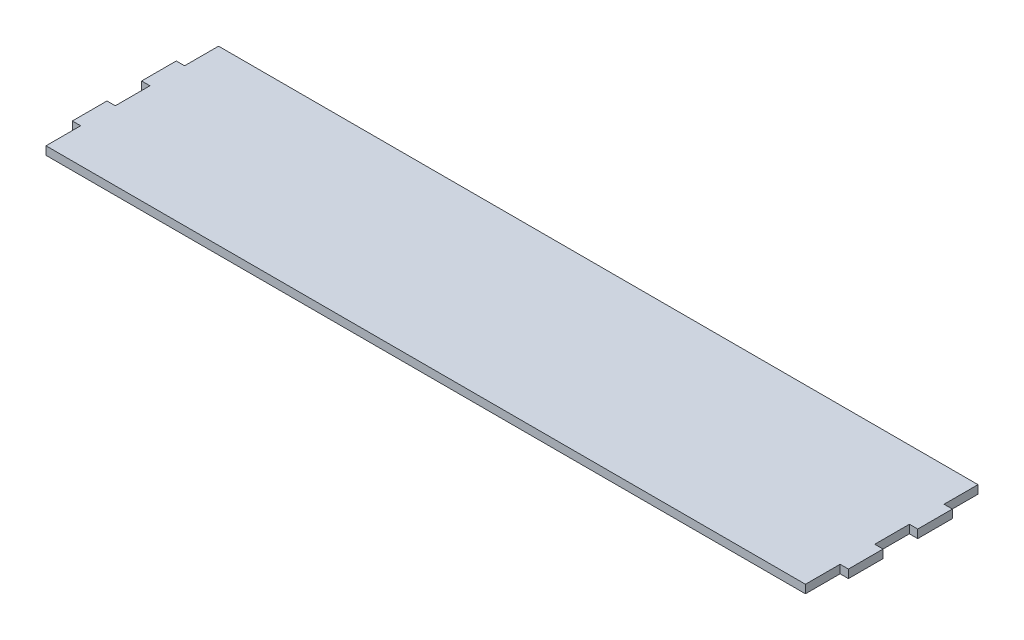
from build123d import *

# Parameters (mm, degrees)
SALIENTE_EXTRUIR1_DEPTH = 12
CROQUIS2_W              = 1096
CROQUIS2_H              = 1
CORTAR_EXTRUIR2_DEPTH   = 574.906786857


with BuildPart() as part:
    # Croquis1 → Saliente-Extruir1 (new body)
    with BuildSketch(Plane(origin=(0, 0, 0), x_dir=(1, 0, 0), z_dir=(0, 1, 0))):
        Polygon((-560, 25), (-560, 75), (-548, 75), (-548, 125), (548, 125), (548, 75), (560, 75), (560, 25), (548, 25), (548, -25), (560, -25), (560, -75), (548, -75), (548, -125), (-548, -125), (-548, -75), (-560, -75), (-560, -25), (-548, -25), (-548, 25), align=None)
    extrude(amount=SALIENTE_EXTRUIR1_DEPTH)

    # Croquis2 → Cortar-Extruir2 (cut, through all)
    with BuildSketch(Plane(origin=(0, 0, 0), x_dir=(1, 0, 0), z_dir=(0, 1, 0))):
        with Locations((0, 124.5)):
            Rectangle(CROQUIS2_W, CROQUIS2_H)
    extrude(amount=CORTAR_EXTRUIR2_DEPTH, mode=Mode.SUBTRACT)


solid = part.part
